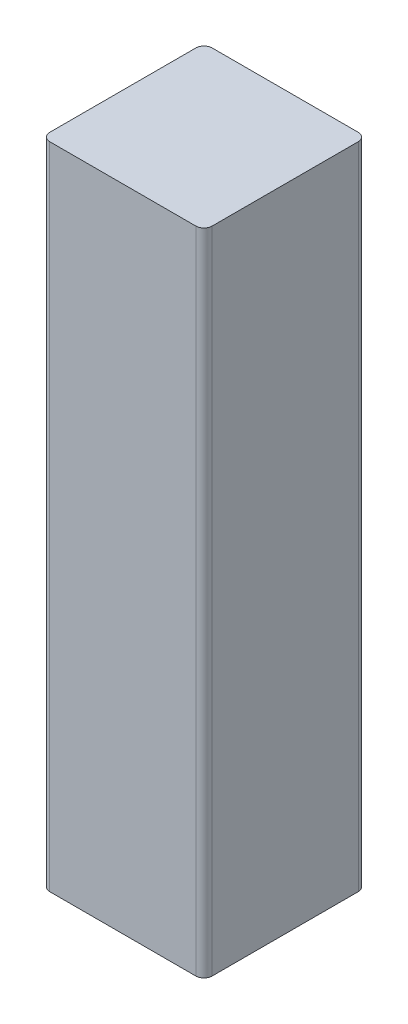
ISO-10303-21;
HEADER;
FILE_DESCRIPTION(('STEP AP214'),'2;1');
FILE_NAME('part.step','',(''),(''),'','','');
FILE_SCHEMA(('AUTOMOTIVE_DESIGN { 1 0 10303 214 1 1 1 1 }'));
ENDSEC;
DATA;
#1=APPLICATION_CONTEXT('core data for automotive mechanical design processes');
#2=APPLICATION_PROTOCOL_DEFINITION('international standard','automotive_design',2000,#1);
#3=PRODUCT_CONTEXT('',#1,'mechanical');
#4=PRODUCT('Part','Part','',(#3));
#5=PRODUCT_RELATED_PRODUCT_CATEGORY('part','',(#4));
#6=PRODUCT_DEFINITION_FORMATION('','',#4);
#7=PRODUCT_DEFINITION_CONTEXT('part definition',#1,'design');
#8=PRODUCT_DEFINITION('design','',#6,#7);
#9=PRODUCT_DEFINITION_SHAPE('','',#8);
#10=(LENGTH_UNIT() NAMED_UNIT(*) SI_UNIT(.MILLI.,.METRE.));
#11=(NAMED_UNIT(*) PLANE_ANGLE_UNIT() SI_UNIT($,.RADIAN.));
#12=(NAMED_UNIT(*) SI_UNIT($,.STERADIAN.) SOLID_ANGLE_UNIT());
#13=UNCERTAINTY_MEASURE_WITH_UNIT(LENGTH_MEASURE(1.E-05),#10,'distance_accuracy_value','');
#14=(GEOMETRIC_REPRESENTATION_CONTEXT(3) GLOBAL_UNCERTAINTY_ASSIGNED_CONTEXT((#13)) GLOBAL_UNIT_ASSIGNED_CONTEXT((#10,
#11,#12)) REPRESENTATION_CONTEXT('',''));
#15=CARTESIAN_POINT('',(0.,0.,0.));
#16=DIRECTION('',(0.,0.,1.));
#17=DIRECTION('',(1.,0.,0.));
#18=AXIS2_PLACEMENT_3D('',#15,#16,#17);
#19=CARTESIAN_POINT('',(-4.5,-20.,4.5));
#20=DIRECTION('',(0.,1.,0.));
#21=DIRECTION('',(0.,0.,1.));
#22=AXIS2_PLACEMENT_3D('',#19,#20,#21);
#23=CYLINDRICAL_SURFACE('',#22,0.5);
#24=CARTESIAN_POINT('',(-4.5,20.,4.5));
#25=DIRECTION('',(0.,1.,0.));
#26=DIRECTION('',(0.,0.,1.));
#27=AXIS2_PLACEMENT_3D('',#24,#25,#26);
#28=CIRCLE('',#27,0.5);
#29=CARTESIAN_POINT('',(-5.,20.,4.5));
#30=VERTEX_POINT('',#29);
#31=CARTESIAN_POINT('',(-4.5,20.,5.));
#32=VERTEX_POINT('',#31);
#33=EDGE_CURVE('E132',#30,#32,#28,.T.);
#34=ORIENTED_EDGE('',*,*,#33,.F.);
#35=DIRECTION('',(0.,1.,0.));
#36=VECTOR('',#35,1.);
#37=CARTESIAN_POINT('',(-5.,-20.,4.5));
#38=LINE('',#37,#36);
#39=CARTESIAN_POINT('',(-5.,-20.,4.5));
#40=VERTEX_POINT('',#39);
#41=EDGE_CURVE('E11',#40,#30,#38,.T.);
#42=ORIENTED_EDGE('',*,*,#41,.F.);
#43=CARTESIAN_POINT('',(-4.5,-20.,4.5));
#44=DIRECTION('',(0.,1.,0.));
#45=DIRECTION('',(0.,0.,1.));
#46=AXIS2_PLACEMENT_3D('',#43,#44,#45);
#47=CIRCLE('',#46,0.5);
#48=CARTESIAN_POINT('',(-4.5,-20.,5.));
#49=VERTEX_POINT('',#48);
#50=EDGE_CURVE('E152',#40,#49,#47,.T.);
#51=ORIENTED_EDGE('',*,*,#50,.T.);
#52=DIRECTION('',(0.,1.,0.));
#53=VECTOR('',#52,1.);
#54=CARTESIAN_POINT('',(-4.5,-20.,5.));
#55=LINE('',#54,#53);
#56=EDGE_CURVE('E38',#49,#32,#55,.T.);
#57=ORIENTED_EDGE('',*,*,#56,.T.);
#58=EDGE_LOOP('',(#34,#42,#51,#57));
#59=FACE_BOUND('',#58,.T.);
#60=ADVANCED_FACE('F35',(#59),#23,.T.);
#61=CARTESIAN_POINT('',(-5.,-20.,-4.5));
#62=DIRECTION('',(-1.,0.,0.));
#63=DIRECTION('',(0.,0.,1.));
#64=AXIS2_PLACEMENT_3D('',#61,#62,#63);
#65=PLANE('',#64);
#66=DIRECTION('',(0.,0.,1.));
#67=VECTOR('',#66,1.);
#68=CARTESIAN_POINT('',(-5.,20.,-4.5));
#69=LINE('',#68,#67);
#70=CARTESIAN_POINT('',(-5.,20.,-4.5));
#71=VERTEX_POINT('',#70);
#72=EDGE_CURVE('E150',#71,#30,#69,.T.);
#73=ORIENTED_EDGE('',*,*,#72,.F.);
#74=DIRECTION('',(0.,1.,0.));
#75=VECTOR('',#74,1.);
#76=CARTESIAN_POINT('',(-5.,-20.,-4.5));
#77=LINE('',#76,#75);
#78=CARTESIAN_POINT('',(-5.,-20.,-4.5));
#79=VERTEX_POINT('',#78);
#80=EDGE_CURVE('E44',#79,#71,#77,.T.);
#81=ORIENTED_EDGE('',*,*,#80,.F.);
#82=DIRECTION('',(0.,0.,1.));
#83=VECTOR('',#82,1.);
#84=CARTESIAN_POINT('',(-5.,-20.,-4.5));
#85=LINE('',#84,#83);
#86=EDGE_CURVE('E122',#79,#40,#85,.T.);
#87=ORIENTED_EDGE('',*,*,#86,.T.);
#88=ORIENTED_EDGE('',*,*,#41,.T.);
#89=EDGE_LOOP('',(#73,#81,#87,#88));
#90=FACE_BOUND('',#89,.T.);
#91=ADVANCED_FACE('F164',(#90),#65,.T.);
#92=CARTESIAN_POINT('',(-4.5,-20.,-4.5));
#93=DIRECTION('',(0.,1.,0.));
#94=DIRECTION('',(0.,0.,1.));
#95=AXIS2_PLACEMENT_3D('',#92,#93,#94);
#96=CYLINDRICAL_SURFACE('',#95,0.5);
#97=CARTESIAN_POINT('',(-4.5,20.,-4.5));
#98=DIRECTION('',(0.,1.,0.));
#99=DIRECTION('',(0.,0.,1.));
#100=AXIS2_PLACEMENT_3D('',#97,#98,#99);
#101=CIRCLE('',#100,0.5);
#102=CARTESIAN_POINT('',(-4.5,20.,-5.));
#103=VERTEX_POINT('',#102);
#104=EDGE_CURVE('E109',#103,#71,#101,.T.);
#105=ORIENTED_EDGE('',*,*,#104,.F.);
#106=DIRECTION('',(0.,1.,0.));
#107=VECTOR('',#106,1.);
#108=CARTESIAN_POINT('',(-4.5,-20.,-5.));
#109=LINE('',#108,#107);
#110=CARTESIAN_POINT('',(-4.5,-20.,-5.));
#111=VERTEX_POINT('',#110);
#112=EDGE_CURVE('E104',#111,#103,#109,.T.);
#113=ORIENTED_EDGE('',*,*,#112,.F.);
#114=CARTESIAN_POINT('',(-4.5,-20.,-4.5));
#115=DIRECTION('',(0.,1.,0.));
#116=DIRECTION('',(0.,0.,1.));
#117=AXIS2_PLACEMENT_3D('',#114,#115,#116);
#118=CIRCLE('',#117,0.5);
#119=EDGE_CURVE('E107',#111,#79,#118,.T.);
#120=ORIENTED_EDGE('',*,*,#119,.T.);
#121=ORIENTED_EDGE('',*,*,#80,.T.);
#122=EDGE_LOOP('',(#105,#113,#120,#121));
#123=FACE_BOUND('',#122,.T.);
#124=ADVANCED_FACE('F106',(#123),#96,.T.);
#125=CARTESIAN_POINT('',(4.5,-20.,-5.));
#126=DIRECTION('',(0.,0.,-1.));
#127=DIRECTION('',(-1.,0.,0.));
#128=AXIS2_PLACEMENT_3D('',#125,#126,#127);
#129=PLANE('',#128);
#130=DIRECTION('',(-1.,0.,0.));
#131=VECTOR('',#130,1.);
#132=CARTESIAN_POINT('',(4.5,20.,-5.));
#133=LINE('',#132,#131);
#134=CARTESIAN_POINT('',(4.5,20.,-5.));
#135=VERTEX_POINT('',#134);
#136=EDGE_CURVE('E147',#135,#103,#133,.T.);
#137=ORIENTED_EDGE('',*,*,#136,.F.);
#138=DIRECTION('',(0.,1.,0.));
#139=VECTOR('',#138,1.);
#140=CARTESIAN_POINT('',(4.5,-20.,-5.));
#141=LINE('',#140,#139);
#142=CARTESIAN_POINT('',(4.5,-20.,-5.));
#143=VERTEX_POINT('',#142);
#144=EDGE_CURVE('E114',#143,#135,#141,.T.);
#145=ORIENTED_EDGE('',*,*,#144,.F.);
#146=DIRECTION('',(-1.,0.,0.));
#147=VECTOR('',#146,1.);
#148=CARTESIAN_POINT('',(4.5,-20.,-5.));
#149=LINE('',#148,#147);
#150=EDGE_CURVE('E120',#143,#111,#149,.T.);
#151=ORIENTED_EDGE('',*,*,#150,.T.);
#152=ORIENTED_EDGE('',*,*,#112,.T.);
#153=EDGE_LOOP('',(#137,#145,#151,#152));
#154=FACE_BOUND('',#153,.T.);
#155=ADVANCED_FACE('F124',(#154),#129,.T.);
#156=CARTESIAN_POINT('',(4.5,-20.,-4.5));
#157=DIRECTION('',(0.,1.,0.));
#158=DIRECTION('',(0.,0.,1.));
#159=AXIS2_PLACEMENT_3D('',#156,#157,#158);
#160=CYLINDRICAL_SURFACE('',#159,0.5);
#161=CARTESIAN_POINT('',(4.5,20.,-4.5));
#162=DIRECTION('',(0.,1.,0.));
#163=DIRECTION('',(0.,0.,1.));
#164=AXIS2_PLACEMENT_3D('',#161,#162,#163);
#165=CIRCLE('',#164,0.5);
#166=CARTESIAN_POINT('',(5.,20.,-4.5));
#167=VERTEX_POINT('',#166);
#168=EDGE_CURVE('E144',#167,#135,#165,.T.);
#169=ORIENTED_EDGE('',*,*,#168,.F.);
#170=DIRECTION('',(0.,1.,0.));
#171=VECTOR('',#170,1.);
#172=CARTESIAN_POINT('',(5.,-20.,-4.5));
#173=LINE('',#172,#171);
#174=CARTESIAN_POINT('',(5.,-20.,-4.5));
#175=VERTEX_POINT('',#174);
#176=EDGE_CURVE('E156',#175,#167,#173,.T.);
#177=ORIENTED_EDGE('',*,*,#176,.F.);
#178=CARTESIAN_POINT('',(4.5,-20.,-4.5));
#179=DIRECTION('',(0.,1.,0.));
#180=DIRECTION('',(0.,0.,1.));
#181=AXIS2_PLACEMENT_3D('',#178,#179,#180);
#182=CIRCLE('',#181,0.5);
#183=EDGE_CURVE('E125',#175,#143,#182,.T.);
#184=ORIENTED_EDGE('',*,*,#183,.T.);
#185=ORIENTED_EDGE('',*,*,#144,.T.);
#186=EDGE_LOOP('',(#169,#177,#184,#185));
#187=FACE_BOUND('',#186,.T.);
#188=ADVANCED_FACE('F177',(#187),#160,.T.);
#189=CARTESIAN_POINT('',(5.,-20.,4.5));
#190=DIRECTION('',(1.,0.,0.));
#191=DIRECTION('',(0.,0.,-1.));
#192=AXIS2_PLACEMENT_3D('',#189,#190,#191);
#193=PLANE('',#192);
#194=DIRECTION('',(0.,0.,-1.));
#195=VECTOR('',#194,1.);
#196=CARTESIAN_POINT('',(5.,20.,4.5));
#197=LINE('',#196,#195);
#198=CARTESIAN_POINT('',(5.,20.,4.5));
#199=VERTEX_POINT('',#198);
#200=EDGE_CURVE('E141',#199,#167,#197,.T.);
#201=ORIENTED_EDGE('',*,*,#200,.F.);
#202=DIRECTION('',(0.,1.,0.));
#203=VECTOR('',#202,1.);
#204=CARTESIAN_POINT('',(5.,-20.,4.5));
#205=LINE('',#204,#203);
#206=CARTESIAN_POINT('',(5.,-20.,4.5));
#207=VERTEX_POINT('',#206);
#208=EDGE_CURVE('E158',#207,#199,#205,.T.);
#209=ORIENTED_EDGE('',*,*,#208,.F.);
#210=DIRECTION('',(0.,0.,-1.));
#211=VECTOR('',#210,1.);
#212=CARTESIAN_POINT('',(5.,-20.,4.5));
#213=LINE('',#212,#211);
#214=EDGE_CURVE('E127',#207,#175,#213,.T.);
#215=ORIENTED_EDGE('',*,*,#214,.T.);
#216=ORIENTED_EDGE('',*,*,#176,.T.);
#217=EDGE_LOOP('',(#201,#209,#215,#216));
#218=FACE_BOUND('',#217,.T.);
#219=ADVANCED_FACE('F180',(#218),#193,.T.);
#220=CARTESIAN_POINT('',(4.5,-20.,4.5));
#221=DIRECTION('',(0.,1.,0.));
#222=DIRECTION('',(0.,0.,1.));
#223=AXIS2_PLACEMENT_3D('',#220,#221,#222);
#224=CYLINDRICAL_SURFACE('',#223,0.5);
#225=CARTESIAN_POINT('',(4.5,20.,4.5));
#226=DIRECTION('',(0.,1.,0.));
#227=DIRECTION('',(0.,0.,1.));
#228=AXIS2_PLACEMENT_3D('',#225,#226,#227);
#229=CIRCLE('',#228,0.5);
#230=CARTESIAN_POINT('',(4.5,20.,5.));
#231=VERTEX_POINT('',#230);
#232=EDGE_CURVE('E138',#231,#199,#229,.T.);
#233=ORIENTED_EDGE('',*,*,#232,.F.);
#234=DIRECTION('',(0.,1.,0.));
#235=VECTOR('',#234,1.);
#236=CARTESIAN_POINT('',(4.5,-20.,5.));
#237=LINE('',#236,#235);
#238=CARTESIAN_POINT('',(4.5,-20.,5.));
#239=VERTEX_POINT('',#238);
#240=EDGE_CURVE('E159',#239,#231,#237,.T.);
#241=ORIENTED_EDGE('',*,*,#240,.F.);
#242=CARTESIAN_POINT('',(4.5,-20.,4.5));
#243=DIRECTION('',(0.,1.,0.));
#244=DIRECTION('',(0.,0.,1.));
#245=AXIS2_PLACEMENT_3D('',#242,#243,#244);
#246=CIRCLE('',#245,0.5);
#247=EDGE_CURVE('E255',#239,#207,#246,.T.);
#248=ORIENTED_EDGE('',*,*,#247,.T.);
#249=ORIENTED_EDGE('',*,*,#208,.T.);
#250=EDGE_LOOP('',(#233,#241,#248,#249));
#251=FACE_BOUND('',#250,.T.);
#252=ADVANCED_FACE('F184',(#251),#224,.T.);
#253=CARTESIAN_POINT('',(-4.5,-20.,5.));
#254=DIRECTION('',(0.,0.,1.));
#255=DIRECTION('',(1.,0.,0.));
#256=AXIS2_PLACEMENT_3D('',#253,#254,#255);
#257=PLANE('',#256);
#258=DIRECTION('',(1.,0.,0.));
#259=VECTOR('',#258,1.);
#260=CARTESIAN_POINT('',(-4.5,20.,5.));
#261=LINE('',#260,#259);
#262=EDGE_CURVE('E135',#32,#231,#261,.T.);
#263=ORIENTED_EDGE('',*,*,#262,.F.);
#264=ORIENTED_EDGE('',*,*,#56,.F.);
#265=DIRECTION('',(1.,0.,0.));
#266=VECTOR('',#265,1.);
#267=CARTESIAN_POINT('',(-4.5,-20.,5.));
#268=LINE('',#267,#266);
#269=EDGE_CURVE('E256',#49,#239,#268,.T.);
#270=ORIENTED_EDGE('',*,*,#269,.T.);
#271=ORIENTED_EDGE('',*,*,#240,.T.);
#272=EDGE_LOOP('',(#263,#264,#270,#271));
#273=FACE_BOUND('',#272,.T.);
#274=ADVANCED_FACE('F161',(#273),#257,.T.);
#275=CARTESIAN_POINT('',(-4.5,-20.,4.5));
#276=DIRECTION('',(0.,1.,0.));
#277=DIRECTION('',(0.,0.,1.));
#278=AXIS2_PLACEMENT_3D('',#275,#276,#277);
#279=PLANE('',#278);
#280=ORIENTED_EDGE('',*,*,#50,.F.);
#281=ORIENTED_EDGE('',*,*,#86,.F.);
#282=ORIENTED_EDGE('',*,*,#119,.F.);
#283=ORIENTED_EDGE('',*,*,#150,.F.);
#284=ORIENTED_EDGE('',*,*,#183,.F.);
#285=ORIENTED_EDGE('',*,*,#214,.F.);
#286=ORIENTED_EDGE('',*,*,#247,.F.);
#287=ORIENTED_EDGE('',*,*,#269,.F.);
#288=EDGE_LOOP('',(#280,#281,#282,#283,#284,#285,#286,#287));
#289=FACE_BOUND('',#288,.T.);
#290=ADVANCED_FACE('F118',(#289),#279,.F.);
#291=CARTESIAN_POINT('',(-4.5,20.,4.5));
#292=DIRECTION('',(0.,1.,0.));
#293=DIRECTION('',(0.,0.,1.));
#294=AXIS2_PLACEMENT_3D('',#291,#292,#293);
#295=PLANE('',#294);
#296=ORIENTED_EDGE('',*,*,#33,.T.);
#297=ORIENTED_EDGE('',*,*,#262,.T.);
#298=ORIENTED_EDGE('',*,*,#232,.T.);
#299=ORIENTED_EDGE('',*,*,#200,.T.);
#300=ORIENTED_EDGE('',*,*,#168,.T.);
#301=ORIENTED_EDGE('',*,*,#136,.T.);
#302=ORIENTED_EDGE('',*,*,#104,.T.);
#303=ORIENTED_EDGE('',*,*,#72,.T.);
#304=EDGE_LOOP('',(#296,#297,#298,#299,#300,#301,#302,#303));
#305=FACE_BOUND('',#304,.T.);
#306=ADVANCED_FACE('F163',(#305),#295,.T.);
#307=CLOSED_SHELL('',(#60,#91,#124,#155,#188,#219,#252,#274,#290,#306));
#308=MANIFOLD_SOLID_BREP('B2',#307);
#309=ADVANCED_BREP_SHAPE_REPRESENTATION('',(#18,#308),#14);
#310=SHAPE_DEFINITION_REPRESENTATION(#9,#309);
ENDSEC;
END-ISO-10303-21;
